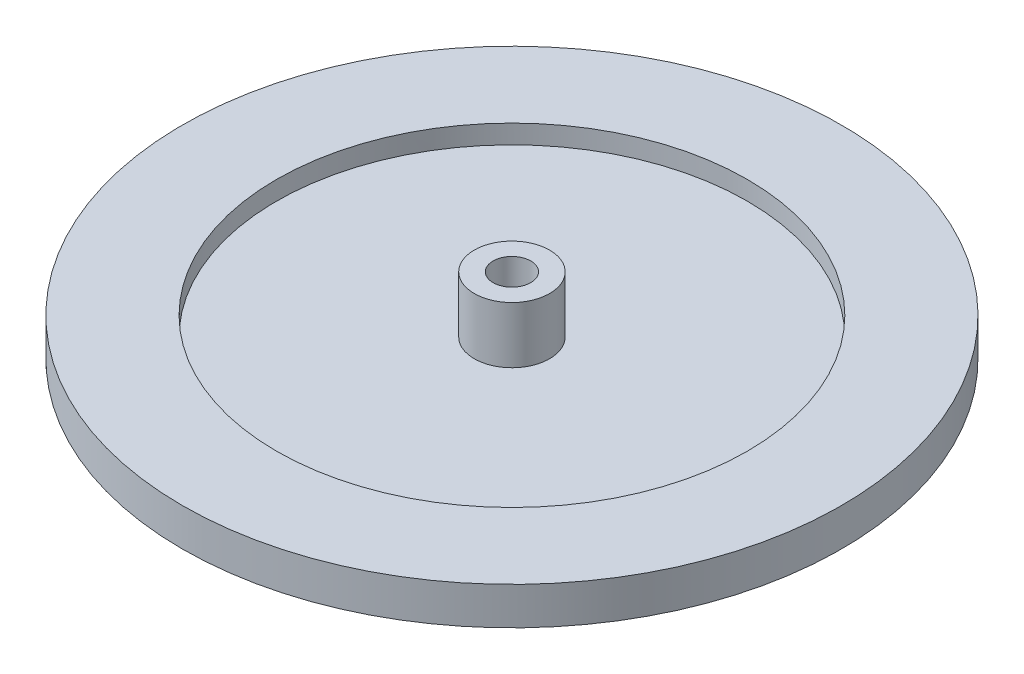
from build123d import *

# Parameters (mm, degrees)
SKETCH_1_R           = 35
SKETCH_1_R_2         = 25
EXTRUDE_1_DEPTH      = 4
SKETCH_3_R           = 6
SKETCH_3_R_2         = 4
EXTRUDE_2_DEPTH      = 2
SKETCH_4_R           = 25
SKETCH_4_R_2         = 4
EXTRUDE_3_DEPTH      = 2
EXTRUDE_4_DEPTH      = 10
EXTRUDE_4_DEPTH_BACK = 8
SKETCH_6_R           = 4
SKETCH_6_R_2         = 2
SKETCH_7_W           = 1.6
SKETCH_7_H           = 1.864968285
CUT_EXTRUDE_3_DEPTH  = 10


with BuildPart() as part:
    # Sketch 1 → Extrude 1 (new body)
    with BuildSketch(Plane(origin=(0, 0, 0), x_dir=(1, 0, 0), z_dir=(0, 1, 0))):
        with Locations(Location((0, 0, 0), (0, 0, 270))):
            Circle(SKETCH_1_R)
        with Locations(Location((0, 0, 0), (0, 0, 270))):
            Circle(SKETCH_1_R_2, mode=Mode.SUBTRACT)
    extrude(amount=EXTRUDE_1_DEPTH)



with BuildPart() as body_2:
    # Sketch 3 → Extrude 2 (new body)
    with BuildSketch(Plane.XZ):
        with Locations(Location((0, 0, 0), (0, 0, 270))):
            Circle(SKETCH_3_R)
        with Locations(Location((0, 0, 0), (0, 0, 270))):
            Circle(SKETCH_3_R_2, mode=Mode.SUBTRACT)
    extrude(amount=-EXTRUDE_2_DEPTH)


with BuildPart() as part_1:
    add(part.part)

    add(body_2.part)  # Extrude 3 merges body 2
    # Sketch 4 → Extrude 3 (add)
    with BuildSketch(Plane.XZ):
        with Locations(Location((0, 0, 0), (0, 0, 270))):
            Circle(SKETCH_4_R)
        with Locations(Location((0, 0, 0), (0, 0, 270))):
            Circle(SKETCH_4_R_2, mode=Mode.SUBTRACT)
    extrude(amount=-EXTRUDE_3_DEPTH)

    # Sketch 6 → Extrude 4 (add, two sides: drawn at the far end of the back side and taken through both)
    with BuildSketch(Plane.XZ.offset(-EXTRUDE_4_DEPTH_BACK)):
        with Locations(Location((0, 0, 0), (0, 0, 270))):
            Circle(SKETCH_6_R)
        with Locations(Location((0, 0, 0), (0, 0, 270))):
            Circle(SKETCH_6_R_2, mode=Mode.SUBTRACT)
    extrude(amount=EXTRUDE_4_DEPTH + EXTRUDE_4_DEPTH_BACK)

    # Sketch 7 → Cut-Extrude 3 (cut)
    with BuildSketch(Plane.XZ.offset(10)):
        with Locations((0, 2.067515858)):
            Rectangle(SKETCH_7_W, SKETCH_7_H)
    extrude(amount=-CUT_EXTRUDE_3_DEPTH, mode=Mode.SUBTRACT)


solid = part_1.part
